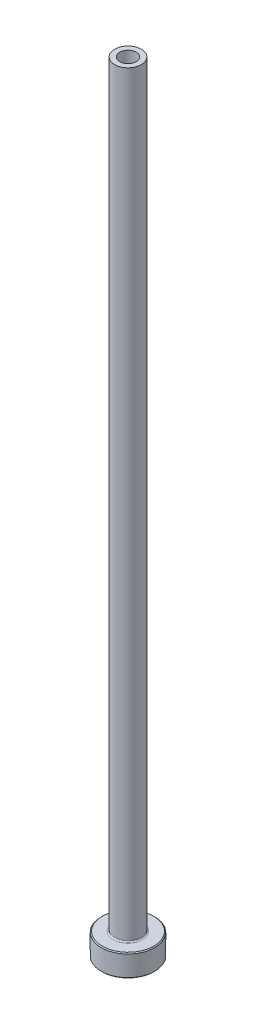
ISO-10303-21;
HEADER;
FILE_DESCRIPTION(('STEP AP214'),'2;1');
FILE_NAME('part.step','',(''),(''),'','','');
FILE_SCHEMA(('AUTOMOTIVE_DESIGN { 1 0 10303 214 1 1 1 1 }'));
ENDSEC;
DATA;
#1=APPLICATION_CONTEXT('core data for automotive mechanical design processes');
#2=APPLICATION_PROTOCOL_DEFINITION('international standard','automotive_design',2000,#1);
#3=PRODUCT_CONTEXT('',#1,'mechanical');
#4=PRODUCT('Part','Part','',(#3));
#5=PRODUCT_RELATED_PRODUCT_CATEGORY('part','',(#4));
#6=PRODUCT_DEFINITION_FORMATION('','',#4);
#7=PRODUCT_DEFINITION_CONTEXT('part definition',#1,'design');
#8=PRODUCT_DEFINITION('design','',#6,#7);
#9=PRODUCT_DEFINITION_SHAPE('','',#8);
#10=(LENGTH_UNIT() NAMED_UNIT(*) SI_UNIT(.MILLI.,.METRE.));
#11=(NAMED_UNIT(*) PLANE_ANGLE_UNIT() SI_UNIT($,.RADIAN.));
#12=(NAMED_UNIT(*) SI_UNIT($,.STERADIAN.) SOLID_ANGLE_UNIT());
#13=UNCERTAINTY_MEASURE_WITH_UNIT(LENGTH_MEASURE(1.E-05),#10,'distance_accuracy_value','');
#14=(GEOMETRIC_REPRESENTATION_CONTEXT(3) GLOBAL_UNCERTAINTY_ASSIGNED_CONTEXT((#13)) GLOBAL_UNIT_ASSIGNED_CONTEXT((#10,
#11,#12)) REPRESENTATION_CONTEXT('',''));
#15=CARTESIAN_POINT('',(0.,0.,0.));
#16=DIRECTION('',(0.,0.,1.));
#17=DIRECTION('',(1.,0.,0.));
#18=AXIS2_PLACEMENT_3D('',#15,#16,#17);
#19=CARTESIAN_POINT('',(0.,92.1876809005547,0.));
#20=DIRECTION('',(0.,1.,0.));
#21=DIRECTION('',(0.,0.,1.));
#22=AXIS2_PLACEMENT_3D('',#19,#20,#21);
#23=CYLINDRICAL_SURFACE('',#22,1.85);
#24=CARTESIAN_POINT('',(0.,175.,0.));
#25=DIRECTION('',(0.,1.,0.));
#26=DIRECTION('',(0.,0.,1.));
#27=AXIS2_PLACEMENT_3D('',#24,#25,#26);
#28=CIRCLE('',#27,1.85);
#29=CARTESIAN_POINT('',(0.,175.,1.85));
#30=VERTEX_POINT('',#29);
#31=EDGE_CURVE('E62',#30,#30,#28,.T.);
#32=ORIENTED_EDGE('',*,*,#31,.T.);
#33=EDGE_LOOP('',(#32));
#34=FACE_BOUND('',#33,.T.);
#35=CARTESIAN_POINT('',(0.,130.,0.));
#36=DIRECTION('',(0.,1.,0.));
#37=DIRECTION('',(0.,0.,1.));
#38=AXIS2_PLACEMENT_3D('',#35,#36,#37);
#39=CIRCLE('',#38,1.85);
#40=CARTESIAN_POINT('',(0.,130.,1.85));
#41=VERTEX_POINT('',#40);
#42=EDGE_CURVE('E71',#41,#41,#39,.T.);
#43=ORIENTED_EDGE('',*,*,#42,.F.);
#44=EDGE_LOOP('',(#43));
#45=FACE_BOUND('',#44,.T.);
#46=ADVANCED_FACE('F30',(#34,#45),#23,.F.);
#47=CARTESIAN_POINT('',(-1.85,175.,0.));
#48=DIRECTION('',(0.,1.,0.));
#49=DIRECTION('',(0.,0.,1.));
#50=AXIS2_PLACEMENT_3D('',#47,#48,#49);
#51=PLANE('',#50);
#52=CARTESIAN_POINT('',(0.,175.,0.));
#53=DIRECTION('',(0.,1.,0.));
#54=DIRECTION('',(0.,0.,1.));
#55=AXIS2_PLACEMENT_3D('',#52,#53,#54);
#56=CIRCLE('',#55,3.00000000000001);
#57=CARTESIAN_POINT('',(0.,175.,3.00000000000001));
#58=VERTEX_POINT('',#57);
#59=EDGE_CURVE('E65',#58,#58,#56,.T.);
#60=ORIENTED_EDGE('',*,*,#59,.T.);
#61=EDGE_LOOP('',(#60));
#62=FACE_BOUND('',#61,.T.);
#63=ORIENTED_EDGE('',*,*,#31,.F.);
#64=EDGE_LOOP('',(#63));
#65=FACE_BOUND('',#64,.T.);
#66=ADVANCED_FACE('F79',(#62,#65),#51,.T.);
#67=CARTESIAN_POINT('',(0.,92.1876809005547,0.));
#68=DIRECTION('',(0.,1.,0.));
#69=DIRECTION('',(0.,0.,1.));
#70=AXIS2_PLACEMENT_3D('',#67,#68,#69);
#71=CYLINDRICAL_SURFACE('',#70,3.);
#72=CARTESIAN_POINT('',(0.,5.3,0.));
#73=DIRECTION('',(0.,1.,0.));
#74=DIRECTION('',(0.,0.,1.));
#75=AXIS2_PLACEMENT_3D('',#72,#73,#74);
#76=CIRCLE('',#75,3.);
#77=CARTESIAN_POINT('',(0.,5.3,3.));
#78=VERTEX_POINT('',#77);
#79=EDGE_CURVE('E59',#78,#78,#76,.T.);
#80=ORIENTED_EDGE('',*,*,#79,.T.);
#81=EDGE_LOOP('',(#80));
#82=FACE_BOUND('',#81,.T.);
#83=ORIENTED_EDGE('',*,*,#59,.F.);
#84=EDGE_LOOP('',(#83));
#85=FACE_BOUND('',#84,.T.);
#86=ADVANCED_FACE('F85',(#82,#85),#71,.T.);
#87=CARTESIAN_POINT('',(-2.99999999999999,5.,0.));
#88=DIRECTION('',(0.,1.,0.));
#89=DIRECTION('',(0.,0.,1.));
#90=AXIS2_PLACEMENT_3D('',#87,#88,#89);
#91=PLANE('',#90);
#92=CARTESIAN_POINT('',(0.,5.,0.));
#93=DIRECTION('',(0.,1.,0.));
#94=DIRECTION('',(0.,0.,1.));
#95=AXIS2_PLACEMENT_3D('',#92,#93,#94);
#96=CIRCLE('',#95,5.79999999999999);
#97=CARTESIAN_POINT('',(0.,5.,5.79999999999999));
#98=VERTEX_POINT('',#97);
#99=EDGE_CURVE('E53',#98,#98,#96,.T.);
#100=ORIENTED_EDGE('',*,*,#99,.T.);
#101=EDGE_LOOP('',(#100));
#102=FACE_BOUND('',#101,.T.);
#103=CARTESIAN_POINT('',(0.,5.,0.));
#104=DIRECTION('',(0.,1.,0.));
#105=DIRECTION('',(0.,0.,1.));
#106=AXIS2_PLACEMENT_3D('',#103,#104,#105);
#107=CIRCLE('',#106,3.3);
#108=CARTESIAN_POINT('',(0.,5.,3.3));
#109=VERTEX_POINT('',#108);
#110=EDGE_CURVE('E56',#109,#109,#107,.F.);
#111=ORIENTED_EDGE('',*,*,#110,.T.);
#112=EDGE_LOOP('',(#111));
#113=FACE_BOUND('',#112,.T.);
#114=ADVANCED_FACE('F111',(#102,#113),#91,.T.);
#115=CARTESIAN_POINT('',(0.,92.1876809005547,0.));
#116=DIRECTION('',(0.,1.,0.));
#117=DIRECTION('',(0.,0.,1.));
#118=AXIS2_PLACEMENT_3D('',#115,#116,#117);
#119=CYLINDRICAL_SURFACE('',#118,5.99999999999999);
#120=CARTESIAN_POINT('',(0.,4.8,0.));
#121=DIRECTION('',(0.,1.,0.));
#122=DIRECTION('',(0.,0.,1.));
#123=AXIS2_PLACEMENT_3D('',#120,#121,#122);
#124=CIRCLE('',#123,5.99999999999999);
#125=CARTESIAN_POINT('',(0.,4.8,5.99999999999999));
#126=VERTEX_POINT('',#125);
#127=EDGE_CURVE('E45',#126,#126,#124,.F.);
#128=ORIENTED_EDGE('',*,*,#127,.T.);
#129=EDGE_LOOP('',(#128));
#130=FACE_BOUND('',#129,.T.);
#131=CARTESIAN_POINT('',(0.,0.20000000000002,0.));
#132=DIRECTION('',(0.,-1.,0.));
#133=DIRECTION('',(0.,0.,-1.));
#134=AXIS2_PLACEMENT_3D('',#131,#132,#133);
#135=CIRCLE('',#134,5.99999999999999);
#136=CARTESIAN_POINT('',(0.,0.20000000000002,-5.99999999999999));
#137=VERTEX_POINT('',#136);
#138=EDGE_CURVE('E50',#137,#137,#135,.F.);
#139=ORIENTED_EDGE('',*,*,#138,.T.);
#140=EDGE_LOOP('',(#139));
#141=FACE_BOUND('',#140,.T.);
#142=ADVANCED_FACE('F108',(#130,#141),#119,.T.);
#143=CARTESIAN_POINT('',(-5.99999999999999,0.,0.));
#144=DIRECTION('',(0.,-1.,0.));
#145=DIRECTION('',(0.,0.,-1.));
#146=AXIS2_PLACEMENT_3D('',#143,#144,#145);
#147=PLANE('',#146);
#148=CARTESIAN_POINT('',(0.,0.,0.));
#149=DIRECTION('',(0.,-1.,0.));
#150=DIRECTION('',(0.,0.,-1.));
#151=AXIS2_PLACEMENT_3D('',#148,#149,#150);
#152=CIRCLE('',#151,2.60000000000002);
#153=CARTESIAN_POINT('',(0.,0.,-2.60000000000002));
#154=VERTEX_POINT('',#153);
#155=EDGE_CURVE('E37',#154,#154,#152,.F.);
#156=ORIENTED_EDGE('',*,*,#155,.T.);
#157=EDGE_LOOP('',(#156));
#158=FACE_BOUND('',#157,.T.);
#159=CARTESIAN_POINT('',(0.,0.,0.));
#160=DIRECTION('',(0.,-1.,0.));
#161=DIRECTION('',(0.,0.,-1.));
#162=AXIS2_PLACEMENT_3D('',#159,#160,#161);
#163=CIRCLE('',#162,5.79999999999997);
#164=CARTESIAN_POINT('',(0.,0.,-5.79999999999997));
#165=VERTEX_POINT('',#164);
#166=EDGE_CURVE('E41',#165,#165,#163,.T.);
#167=ORIENTED_EDGE('',*,*,#166,.T.);
#168=EDGE_LOOP('',(#167));
#169=FACE_BOUND('',#168,.T.);
#170=ADVANCED_FACE('F110',(#158,#169),#147,.T.);
#171=CARTESIAN_POINT('',(0.,92.1876809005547,0.));
#172=DIRECTION('',(0.,1.,0.));
#173=DIRECTION('',(0.,0.,1.));
#174=AXIS2_PLACEMENT_3D('',#171,#172,#173);
#175=CYLINDRICAL_SURFACE('',#174,2.1);
#176=CARTESIAN_POINT('',(0.,0.500000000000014,0.));
#177=DIRECTION('',(0.,-1.,0.));
#178=DIRECTION('',(0.,0.,-1.));
#179=AXIS2_PLACEMENT_3D('',#176,#177,#178);
#180=CIRCLE('',#179,2.1);
#181=CARTESIAN_POINT('',(0.,0.500000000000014,-2.1));
#182=VERTEX_POINT('',#181);
#183=EDGE_CURVE('E10',#182,#182,#180,.T.);
#184=ORIENTED_EDGE('',*,*,#183,.T.);
#185=EDGE_LOOP('',(#184));
#186=FACE_BOUND('',#185,.T.);
#187=CARTESIAN_POINT('',(0.,118.,0.));
#188=DIRECTION('',(0.,1.,0.));
#189=DIRECTION('',(0.,0.,1.));
#190=AXIS2_PLACEMENT_3D('',#187,#188,#189);
#191=CIRCLE('',#190,2.1);
#192=CARTESIAN_POINT('',(0.,118.,2.1));
#193=VERTEX_POINT('',#192);
#194=EDGE_CURVE('E68',#193,#193,#191,.T.);
#195=ORIENTED_EDGE('',*,*,#194,.T.);
#196=EDGE_LOOP('',(#195));
#197=FACE_BOUND('',#196,.T.);
#198=ADVANCED_FACE('F118',(#186,#197),#175,.F.);
#199=CARTESIAN_POINT('',(0.,118.,0.));
#200=DIRECTION('',(0.,-1.,0.));
#201=DIRECTION('',(0.,0.,-1.));
#202=AXIS2_PLACEMENT_3D('',#199,#200,#201);
#203=CONICAL_SURFACE('',#202,2.1,0.0208303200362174);
#204=ORIENTED_EDGE('',*,*,#42,.T.);
#205=EDGE_LOOP('',(#204));
#206=FACE_BOUND('',#205,.T.);
#207=ORIENTED_EDGE('',*,*,#194,.F.);
#208=EDGE_LOOP('',(#207));
#209=FACE_BOUND('',#208,.T.);
#210=ADVANCED_FACE('F75',(#206,#209),#203,.F.);
#211=CARTESIAN_POINT('',(0.,5.3,0.));
#212=DIRECTION('',(0.,1.,0.));
#213=DIRECTION('',(0.,0.,1.));
#214=AXIS2_PLACEMENT_3D('',#211,#212,#213);
#215=TOROIDAL_SURFACE('',#214,3.3,0.3);
#216=ORIENTED_EDGE('',*,*,#110,.F.);
#217=EDGE_LOOP('',(#216));
#218=FACE_BOUND('',#217,.T.);
#219=ORIENTED_EDGE('',*,*,#79,.F.);
#220=EDGE_LOOP('',(#219));
#221=FACE_BOUND('',#220,.T.);
#222=ADVANCED_FACE('F90',(#218,#221),#215,.F.);
#223=CARTESIAN_POINT('',(0.,5.,0.));
#224=DIRECTION('',(0.,-1.,0.));
#225=DIRECTION('',(0.,0.,-1.));
#226=AXIS2_PLACEMENT_3D('',#223,#224,#225);
#227=CONICAL_SURFACE('',#226,5.79999999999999,0.785398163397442);
#228=ORIENTED_EDGE('',*,*,#127,.F.);
#229=EDGE_LOOP('',(#228));
#230=FACE_BOUND('',#229,.T.);
#231=ORIENTED_EDGE('',*,*,#99,.F.);
#232=EDGE_LOOP('',(#231));
#233=FACE_BOUND('',#232,.T.);
#234=ADVANCED_FACE('F93',(#230,#233),#227,.T.);
#235=CARTESIAN_POINT('',(0.,0.20000000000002,0.));
#236=DIRECTION('',(0.,1.,0.));
#237=DIRECTION('',(0.,0.,1.));
#238=AXIS2_PLACEMENT_3D('',#235,#236,#237);
#239=CONICAL_SURFACE('',#238,5.99999999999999,0.78539816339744);
#240=ORIENTED_EDGE('',*,*,#166,.F.);
#241=EDGE_LOOP('',(#240));
#242=FACE_BOUND('',#241,.T.);
#243=ORIENTED_EDGE('',*,*,#138,.F.);
#244=EDGE_LOOP('',(#243));
#245=FACE_BOUND('',#244,.T.);
#246=ADVANCED_FACE('F96',(#242,#245),#239,.T.);
#247=CARTESIAN_POINT('',(0.,0.,0.));
#248=DIRECTION('',(0.,-1.,0.));
#249=DIRECTION('',(0.,0.,-1.));
#250=AXIS2_PLACEMENT_3D('',#247,#248,#249);
#251=CONICAL_SURFACE('',#250,2.60000000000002,0.785398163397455);
#252=ORIENTED_EDGE('',*,*,#183,.F.);
#253=EDGE_LOOP('',(#252));
#254=FACE_BOUND('',#253,.T.);
#255=ORIENTED_EDGE('',*,*,#155,.F.);
#256=EDGE_LOOP('',(#255));
#257=FACE_BOUND('',#256,.T.);
#258=ADVANCED_FACE('F32',(#254,#257),#251,.F.);
#259=CLOSED_SHELL('',(#46,#66,#86,#114,#142,#170,#198,#210,#222,#234,#246,#258));
#260=MANIFOLD_SOLID_BREP('B2',#259);
#261=ADVANCED_BREP_SHAPE_REPRESENTATION('',(#18,#260),#14);
#262=SHAPE_DEFINITION_REPRESENTATION(#9,#261);
ENDSEC;
END-ISO-10303-21;
